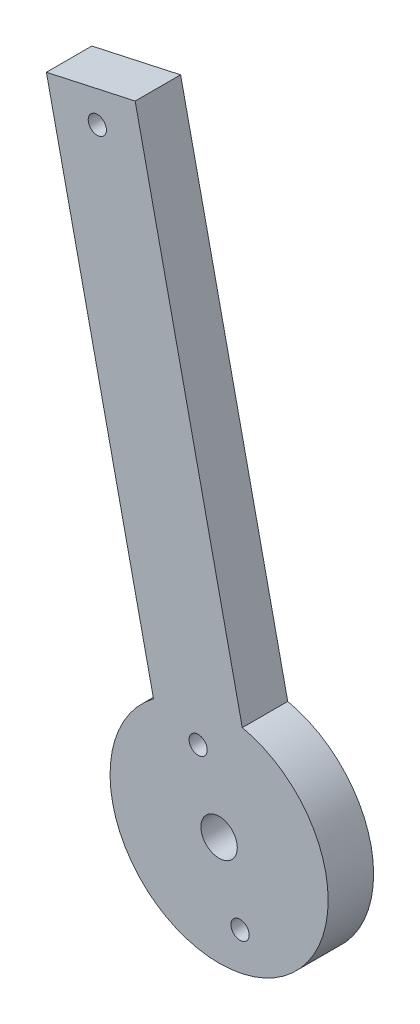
from build123d import *

# Parameters (mm, degrees)
BOSS_EXTRUDE1_DEPTH = 5
SKETCH2_R           = 2
SKETCH2_R_2         = 1
CUT_EXTRUDE1_DEPTH  = 5
SKETCH3_R           = 1
CUT_EXTRUDE2_DEPTH  = 5


with BuildPart() as part:
    # Sketch1 → Boss-Extrude1 (new body)
    with BuildSketch(Plane.XY):
        with BuildLine():
            Line((-7.217985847, 9.586484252), (-19.003890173, 63.402304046))
            Line((-19.003890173, 63.402304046), (-9.235409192, 65.541644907))
            Line((-9.235409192, 65.541644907), (2.550495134, 11.725825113))
            ThreePointArc((2.550495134, 11.725825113), (2.567209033, -11.722177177), (-7.217985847, 9.586484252))
        make_face()
    extrude(amount=BOSS_EXTRUDE1_DEPTH)

    # Sketch2 → Cut-Extrude1 (cut)
    with BuildSketch(Plane.XY.offset(5)):
        Circle(SKETCH2_R)
        with Locations((-13.400617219, 61.188788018)):
            Circle(SKETCH2_R_2)
    extrude(amount=-CUT_EXTRUDE1_DEPTH, mode=Mode.SUBTRACT)

    # Sketch3 → Cut-Extrude2 (cut)
    with BuildSketch(Plane.XY.offset(5)):
        with Locations((-2.304233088, 7.660973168)):
            Circle(SKETCH3_R)
        with Locations((2.304233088, -7.660973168)):
            Circle(SKETCH3_R)
    extrude(amount=-CUT_EXTRUDE2_DEPTH, mode=Mode.SUBTRACT)


solid = part.part
